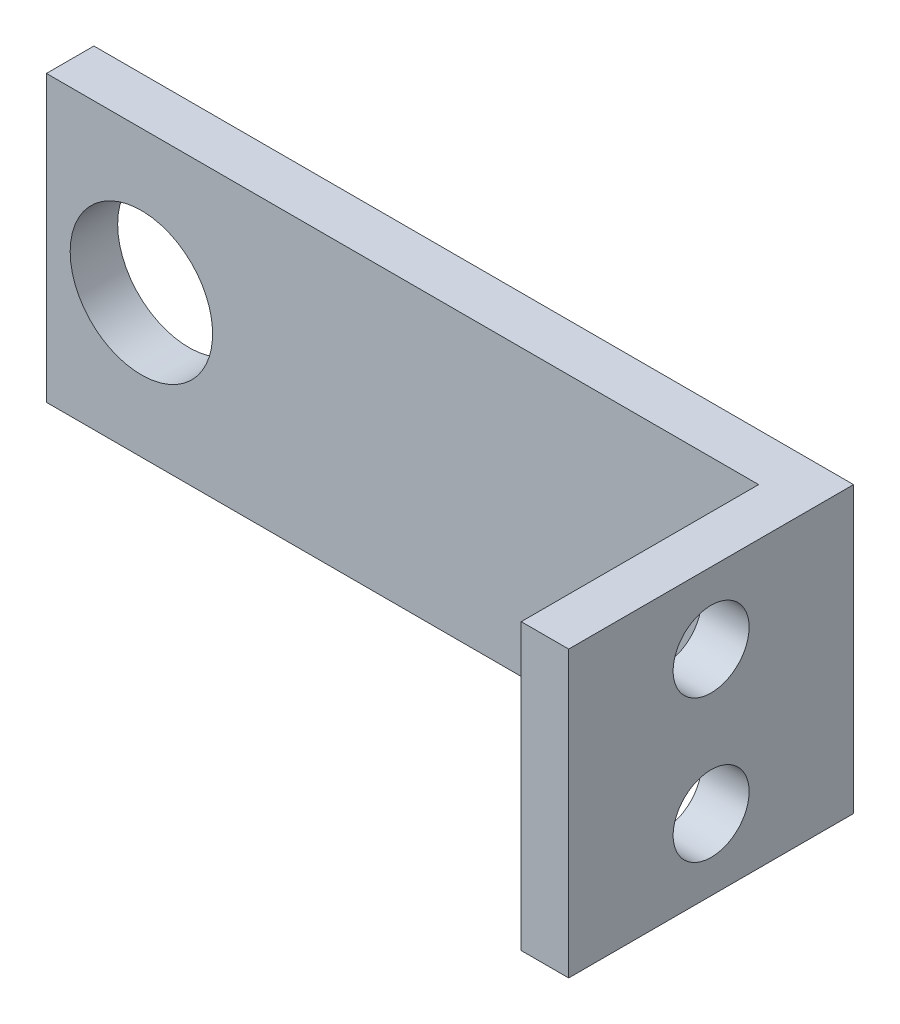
ISO-10303-21;
HEADER;
FILE_DESCRIPTION(('STEP AP214'),'2;1');
FILE_NAME('part.step','',(''),(''),'','','');
FILE_SCHEMA(('AUTOMOTIVE_DESIGN { 1 0 10303 214 1 1 1 1 }'));
ENDSEC;
DATA;
#1=APPLICATION_CONTEXT('core data for automotive mechanical design processes');
#2=APPLICATION_PROTOCOL_DEFINITION('international standard','automotive_design',2000,#1);
#3=PRODUCT_CONTEXT('',#1,'mechanical');
#4=PRODUCT('Part','Part','',(#3));
#5=PRODUCT_RELATED_PRODUCT_CATEGORY('part','',(#4));
#6=PRODUCT_DEFINITION_FORMATION('','',#4);
#7=PRODUCT_DEFINITION_CONTEXT('part definition',#1,'design');
#8=PRODUCT_DEFINITION('design','',#6,#7);
#9=PRODUCT_DEFINITION_SHAPE('','',#8);
#10=(LENGTH_UNIT() NAMED_UNIT(*) SI_UNIT(.MILLI.,.METRE.));
#11=(NAMED_UNIT(*) PLANE_ANGLE_UNIT() SI_UNIT($,.RADIAN.));
#12=(NAMED_UNIT(*) SI_UNIT($,.STERADIAN.) SOLID_ANGLE_UNIT());
#13=UNCERTAINTY_MEASURE_WITH_UNIT(LENGTH_MEASURE(1.E-05),#10,'distance_accuracy_value','');
#14=(GEOMETRIC_REPRESENTATION_CONTEXT(3) GLOBAL_UNCERTAINTY_ASSIGNED_CONTEXT((#13)) GLOBAL_UNIT_ASSIGNED_CONTEXT((#10,
#11,#12)) REPRESENTATION_CONTEXT('',''));
#15=CARTESIAN_POINT('',(0.,0.,0.));
#16=DIRECTION('',(0.,0.,1.));
#17=DIRECTION('',(1.,0.,0.));
#18=AXIS2_PLACEMENT_3D('',#15,#16,#17);
#19=CARTESIAN_POINT('',(0.,30.,5.));
#20=DIRECTION('',(0.,0.,-1.));
#21=DIRECTION('',(-1.,0.,0.));
#22=AXIS2_PLACEMENT_3D('',#19,#20,#21);
#23=PLANE('',#22);
#24=CARTESIAN_POINT('',(9.99999999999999,15.,5.));
#25=DIRECTION('',(0.,0.,-1.));
#26=DIRECTION('',(-1.,0.,0.));
#27=AXIS2_PLACEMENT_3D('',#24,#25,#26);
#28=CIRCLE('',#27,7.5);
#29=CARTESIAN_POINT('',(2.5,15.,5.));
#30=VERTEX_POINT('',#29);
#31=EDGE_CURVE('E103',#30,#30,#28,.T.);
#32=ORIENTED_EDGE('',*,*,#31,.T.);
#33=EDGE_LOOP('',(#32));
#34=FACE_BOUND('',#33,.T.);
#35=DIRECTION('',(0.,-1.,0.));
#36=VECTOR('',#35,1.);
#37=CARTESIAN_POINT('',(75.,30.,5.));
#38=LINE('',#37,#36);
#39=CARTESIAN_POINT('',(75.,30.,5.));
#40=VERTEX_POINT('',#39);
#41=CARTESIAN_POINT('',(75.,0.,5.));
#42=VERTEX_POINT('',#41);
#43=EDGE_CURVE('E52',#40,#42,#38,.T.);
#44=ORIENTED_EDGE('',*,*,#43,.F.);
#45=DIRECTION('',(-1.,0.,0.));
#46=VECTOR('',#45,1.);
#47=CARTESIAN_POINT('',(0.,30.,5.));
#48=LINE('',#47,#46);
#49=CARTESIAN_POINT('',(0.,30.,5.));
#50=VERTEX_POINT('',#49);
#51=EDGE_CURVE('E56',#40,#50,#48,.T.);
#52=ORIENTED_EDGE('',*,*,#51,.T.);
#53=DIRECTION('',(0.,-1.,0.));
#54=VECTOR('',#53,1.);
#55=CARTESIAN_POINT('',(0.,0.,5.));
#56=LINE('',#55,#54);
#57=CARTESIAN_POINT('',(0.,0.,5.));
#58=VERTEX_POINT('',#57);
#59=EDGE_CURVE('E88',#50,#58,#56,.T.);
#60=ORIENTED_EDGE('',*,*,#59,.T.);
#61=DIRECTION('',(1.,0.,0.));
#62=VECTOR('',#61,1.);
#63=CARTESIAN_POINT('',(0.,0.,5.));
#64=LINE('',#63,#62);
#65=EDGE_CURVE('E86',#58,#42,#64,.T.);
#66=ORIENTED_EDGE('',*,*,#65,.T.);
#67=EDGE_LOOP('',(#44,#52,#60,#66));
#68=FACE_BOUND('',#67,.T.);
#69=ADVANCED_FACE('F35',(#34,#68),#23,.F.);
#70=CARTESIAN_POINT('',(0.,0.,5.));
#71=DIRECTION('',(1.,0.,0.));
#72=DIRECTION('',(0.,0.,-1.));
#73=AXIS2_PLACEMENT_3D('',#70,#71,#72);
#74=PLANE('',#73);
#75=DIRECTION('',(0.,-1.,0.));
#76=VECTOR('',#75,1.);
#77=CARTESIAN_POINT('',(0.,0.,0.));
#78=LINE('',#77,#76);
#79=CARTESIAN_POINT('',(0.,30.,0.));
#80=VERTEX_POINT('',#79);
#81=CARTESIAN_POINT('',(0.,0.,0.));
#82=VERTEX_POINT('',#81);
#83=EDGE_CURVE('E109',#80,#82,#78,.T.);
#84=ORIENTED_EDGE('',*,*,#83,.T.);
#85=DIRECTION('',(0.,0.,-1.));
#86=VECTOR('',#85,1.);
#87=CARTESIAN_POINT('',(0.,0.,5.));
#88=LINE('',#87,#86);
#89=EDGE_CURVE('E11',#58,#82,#88,.T.);
#90=ORIENTED_EDGE('',*,*,#89,.F.);
#91=ORIENTED_EDGE('',*,*,#59,.F.);
#92=DIRECTION('',(0.,0.,-1.));
#93=VECTOR('',#92,1.);
#94=CARTESIAN_POINT('',(0.,30.,5.));
#95=LINE('',#94,#93);
#96=EDGE_CURVE('E157',#50,#80,#95,.T.);
#97=ORIENTED_EDGE('',*,*,#96,.T.);
#98=EDGE_LOOP('',(#84,#90,#91,#97));
#99=FACE_BOUND('',#98,.T.);
#100=ADVANCED_FACE('F37',(#99),#74,.F.);
#101=CARTESIAN_POINT('',(0.,0.,5.));
#102=DIRECTION('',(0.,1.,0.));
#103=DIRECTION('',(0.,0.,1.));
#104=AXIS2_PLACEMENT_3D('',#101,#102,#103);
#105=PLANE('',#104);
#106=DIRECTION('',(1.,0.,0.));
#107=VECTOR('',#106,1.);
#108=CARTESIAN_POINT('',(0.,0.,0.));
#109=LINE('',#108,#107);
#110=CARTESIAN_POINT('',(80.,0.,0.));
#111=VERTEX_POINT('',#110);
#112=EDGE_CURVE('E145',#82,#111,#109,.T.);
#113=ORIENTED_EDGE('',*,*,#112,.T.);
#114=DIRECTION('',(0.,0.,-1.));
#115=VECTOR('',#114,1.);
#116=CARTESIAN_POINT('',(80.,0.,5.));
#117=LINE('',#116,#115);
#118=CARTESIAN_POINT('',(80.,0.,30.));
#119=VERTEX_POINT('',#118);
#120=EDGE_CURVE('E44',#119,#111,#117,.T.);
#121=ORIENTED_EDGE('',*,*,#120,.F.);
#122=DIRECTION('',(1.,0.,0.));
#123=VECTOR('',#122,1.);
#124=CARTESIAN_POINT('',(80.,0.,30.));
#125=LINE('',#124,#123);
#126=CARTESIAN_POINT('',(75.,0.,30.));
#127=VERTEX_POINT('',#126);
#128=EDGE_CURVE('E107',#127,#119,#125,.T.);
#129=ORIENTED_EDGE('',*,*,#128,.F.);
#130=DIRECTION('',(0.,0.,-1.));
#131=VECTOR('',#130,1.);
#132=CARTESIAN_POINT('',(75.,0.,30.));
#133=LINE('',#132,#131);
#134=EDGE_CURVE('E98',#127,#42,#133,.T.);
#135=ORIENTED_EDGE('',*,*,#134,.T.);
#136=ORIENTED_EDGE('',*,*,#65,.F.);
#137=ORIENTED_EDGE('',*,*,#89,.T.);
#138=EDGE_LOOP('',(#113,#121,#129,#135,#136,#137));
#139=FACE_BOUND('',#138,.T.);
#140=ADVANCED_FACE('F105',(#139),#105,.F.);
#141=CARTESIAN_POINT('',(80.,0.,5.));
#142=DIRECTION('',(-1.,0.,0.));
#143=DIRECTION('',(0.,0.,1.));
#144=AXIS2_PLACEMENT_3D('',#141,#142,#143);
#145=PLANE('',#144);
#146=CARTESIAN_POINT('',(80.,7.5,15.));
#147=DIRECTION('',(1.,0.,0.));
#148=DIRECTION('',(0.,0.,-1.));
#149=AXIS2_PLACEMENT_3D('',#146,#147,#148);
#150=CIRCLE('',#149,4.);
#151=CARTESIAN_POINT('',(80.,7.5,11.));
#152=VERTEX_POINT('',#151);
#153=EDGE_CURVE('E132',#152,#152,#150,.T.);
#154=ORIENTED_EDGE('',*,*,#153,.F.);
#155=EDGE_LOOP('',(#154));
#156=FACE_BOUND('',#155,.T.);
#157=CARTESIAN_POINT('',(80.,22.5,15.));
#158=DIRECTION('',(1.,0.,0.));
#159=DIRECTION('',(0.,0.,-1.));
#160=AXIS2_PLACEMENT_3D('',#157,#158,#159);
#161=CIRCLE('',#160,4.);
#162=CARTESIAN_POINT('',(80.,22.5,11.));
#163=VERTEX_POINT('',#162);
#164=EDGE_CURVE('E122',#163,#163,#161,.T.);
#165=ORIENTED_EDGE('',*,*,#164,.F.);
#166=EDGE_LOOP('',(#165));
#167=FACE_BOUND('',#166,.T.);
#168=DIRECTION('',(0.,1.,0.));
#169=VECTOR('',#168,1.);
#170=CARTESIAN_POINT('',(80.,0.,0.));
#171=LINE('',#170,#169);
#172=CARTESIAN_POINT('',(80.,30.,0.));
#173=VERTEX_POINT('',#172);
#174=EDGE_CURVE('E147',#111,#173,#171,.T.);
#175=ORIENTED_EDGE('',*,*,#174,.T.);
#176=DIRECTION('',(0.,0.,-1.));
#177=VECTOR('',#176,1.);
#178=CARTESIAN_POINT('',(80.,30.,5.));
#179=LINE('',#178,#177);
#180=CARTESIAN_POINT('',(80.,30.,30.));
#181=VERTEX_POINT('',#180);
#182=EDGE_CURVE('E159',#181,#173,#179,.T.);
#183=ORIENTED_EDGE('',*,*,#182,.F.);
#184=DIRECTION('',(0.,1.,0.));
#185=VECTOR('',#184,1.);
#186=CARTESIAN_POINT('',(80.,30.,30.));
#187=LINE('',#186,#185);
#188=EDGE_CURVE('E102',#119,#181,#187,.T.);
#189=ORIENTED_EDGE('',*,*,#188,.F.);
#190=ORIENTED_EDGE('',*,*,#120,.T.);
#191=EDGE_LOOP('',(#175,#183,#189,#190));
#192=FACE_BOUND('',#191,.T.);
#193=ADVANCED_FACE('F168',(#156,#167,#192),#145,.F.);
#194=CARTESIAN_POINT('',(0.,30.,5.));
#195=DIRECTION('',(0.,-1.,0.));
#196=DIRECTION('',(0.,0.,-1.));
#197=AXIS2_PLACEMENT_3D('',#194,#195,#196);
#198=PLANE('',#197);
#199=DIRECTION('',(-1.,0.,0.));
#200=VECTOR('',#199,1.);
#201=CARTESIAN_POINT('',(0.,30.,0.));
#202=LINE('',#201,#200);
#203=EDGE_CURVE('E149',#173,#80,#202,.T.);
#204=ORIENTED_EDGE('',*,*,#203,.T.);
#205=ORIENTED_EDGE('',*,*,#96,.F.);
#206=ORIENTED_EDGE('',*,*,#51,.F.);
#207=DIRECTION('',(0.,0.,-1.));
#208=VECTOR('',#207,1.);
#209=CARTESIAN_POINT('',(75.,30.,30.));
#210=LINE('',#209,#208);
#211=CARTESIAN_POINT('',(75.,30.,30.));
#212=VERTEX_POINT('',#211);
#213=EDGE_CURVE('E101',#212,#40,#210,.T.);
#214=ORIENTED_EDGE('',*,*,#213,.F.);
#215=DIRECTION('',(-1.,0.,0.));
#216=VECTOR('',#215,1.);
#217=CARTESIAN_POINT('',(80.,30.,30.));
#218=LINE('',#217,#216);
#219=EDGE_CURVE('E140',#181,#212,#218,.T.);
#220=ORIENTED_EDGE('',*,*,#219,.F.);
#221=ORIENTED_EDGE('',*,*,#182,.T.);
#222=EDGE_LOOP('',(#204,#205,#206,#214,#220,#221));
#223=FACE_BOUND('',#222,.T.);
#224=ADVANCED_FACE('F173',(#223),#198,.F.);
#225=CARTESIAN_POINT('',(0.,30.,0.));
#226=DIRECTION('',(0.,0.,-1.));
#227=DIRECTION('',(-1.,0.,0.));
#228=AXIS2_PLACEMENT_3D('',#225,#226,#227);
#229=PLANE('',#228);
#230=CARTESIAN_POINT('',(9.99999999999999,15.,0.));
#231=DIRECTION('',(0.,0.,-1.));
#232=DIRECTION('',(-1.,0.,0.));
#233=AXIS2_PLACEMENT_3D('',#230,#231,#232);
#234=CIRCLE('',#233,7.5);
#235=CARTESIAN_POINT('',(2.5,15.,0.));
#236=VERTEX_POINT('',#235);
#237=EDGE_CURVE('E121',#236,#236,#234,.T.);
#238=ORIENTED_EDGE('',*,*,#237,.F.);
#239=EDGE_LOOP('',(#238));
#240=FACE_BOUND('',#239,.T.);
#241=ORIENTED_EDGE('',*,*,#83,.F.);
#242=ORIENTED_EDGE('',*,*,#203,.F.);
#243=ORIENTED_EDGE('',*,*,#174,.F.);
#244=ORIENTED_EDGE('',*,*,#112,.F.);
#245=EDGE_LOOP('',(#241,#242,#243,#244));
#246=FACE_BOUND('',#245,.T.);
#247=ADVANCED_FACE('F171',(#240,#246),#229,.T.);
#248=CARTESIAN_POINT('',(75.,30.,30.));
#249=DIRECTION('',(1.,0.,0.));
#250=DIRECTION('',(0.,0.,-1.));
#251=AXIS2_PLACEMENT_3D('',#248,#249,#250);
#252=PLANE('',#251);
#253=CARTESIAN_POINT('',(75.,7.5,15.));
#254=DIRECTION('',(1.,0.,0.));
#255=DIRECTION('',(0.,0.,-1.));
#256=AXIS2_PLACEMENT_3D('',#253,#254,#255);
#257=CIRCLE('',#256,4.);
#258=CARTESIAN_POINT('',(75.,7.5,11.));
#259=VERTEX_POINT('',#258);
#260=EDGE_CURVE('E39',#259,#259,#257,.T.);
#261=ORIENTED_EDGE('',*,*,#260,.T.);
#262=EDGE_LOOP('',(#261));
#263=FACE_BOUND('',#262,.T.);
#264=CARTESIAN_POINT('',(75.,22.5,15.));
#265=DIRECTION('',(1.,0.,0.));
#266=DIRECTION('',(0.,0.,-1.));
#267=AXIS2_PLACEMENT_3D('',#264,#265,#266);
#268=CIRCLE('',#267,4.);
#269=CARTESIAN_POINT('',(75.,22.5,11.));
#270=VERTEX_POINT('',#269);
#271=EDGE_CURVE('E119',#270,#270,#268,.T.);
#272=ORIENTED_EDGE('',*,*,#271,.T.);
#273=EDGE_LOOP('',(#272));
#274=FACE_BOUND('',#273,.T.);
#275=ORIENTED_EDGE('',*,*,#43,.T.);
#276=ORIENTED_EDGE('',*,*,#134,.F.);
#277=DIRECTION('',(0.,-1.,0.));
#278=VECTOR('',#277,1.);
#279=CARTESIAN_POINT('',(75.,30.,30.));
#280=LINE('',#279,#278);
#281=EDGE_CURVE('E111',#212,#127,#280,.T.);
#282=ORIENTED_EDGE('',*,*,#281,.F.);
#283=ORIENTED_EDGE('',*,*,#213,.T.);
#284=EDGE_LOOP('',(#275,#276,#282,#283));
#285=FACE_BOUND('',#284,.T.);
#286=ADVANCED_FACE('F96',(#263,#274,#285),#252,.F.);
#287=CARTESIAN_POINT('',(80.,0.,30.));
#288=DIRECTION('',(0.,0.,-1.));
#289=DIRECTION('',(-1.,0.,0.));
#290=AXIS2_PLACEMENT_3D('',#287,#288,#289);
#291=PLANE('',#290);
#292=ORIENTED_EDGE('',*,*,#188,.T.);
#293=ORIENTED_EDGE('',*,*,#219,.T.);
#294=ORIENTED_EDGE('',*,*,#281,.T.);
#295=ORIENTED_EDGE('',*,*,#128,.T.);
#296=EDGE_LOOP('',(#292,#293,#294,#295));
#297=FACE_BOUND('',#296,.T.);
#298=ADVANCED_FACE('F176',(#297),#291,.F.);
#299=CARTESIAN_POINT('',(9.99999999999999,15.,30.000025));
#300=DIRECTION('',(0.,0.,-1.));
#301=DIRECTION('',(-1.,0.,0.));
#302=AXIS2_PLACEMENT_3D('',#299,#300,#301);
#303=CYLINDRICAL_SURFACE('',#302,7.5);
#304=CARTESIAN_POINT('',(2.5,15.,0.));
#305=CARTESIAN_POINT('',(2.5,15.,0.0520833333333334));
#306=CARTESIAN_POINT('',(2.5,15.,0.104166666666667));
#307=CARTESIAN_POINT('',(2.5,15.,0.208333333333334));
#308=CARTESIAN_POINT('',(2.5,15.,0.260416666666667));
#309=CARTESIAN_POINT('',(2.5,15.,0.364583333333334));
#310=CARTESIAN_POINT('',(2.5,15.,0.416666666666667));
#311=CARTESIAN_POINT('',(2.5,15.,0.520833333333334));
#312=CARTESIAN_POINT('',(2.5,15.,0.572916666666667));
#313=CARTESIAN_POINT('',(2.5,15.,0.677083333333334));
#314=CARTESIAN_POINT('',(2.5,15.,0.729166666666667));
#315=CARTESIAN_POINT('',(2.5,15.,0.833333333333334));
#316=CARTESIAN_POINT('',(2.5,15.,0.885416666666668));
#317=CARTESIAN_POINT('',(2.5,15.,0.989583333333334));
#318=CARTESIAN_POINT('',(2.5,15.,1.04166666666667));
#319=CARTESIAN_POINT('',(2.5,15.,1.14583333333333));
#320=CARTESIAN_POINT('',(2.5,15.,1.19791666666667));
#321=CARTESIAN_POINT('',(2.5,15.,1.30208333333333));
#322=CARTESIAN_POINT('',(2.5,15.,1.35416666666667));
#323=CARTESIAN_POINT('',(2.5,15.,1.45833333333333));
#324=CARTESIAN_POINT('',(2.5,15.,1.51041666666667));
#325=CARTESIAN_POINT('',(2.5,15.,1.61458333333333));
#326=CARTESIAN_POINT('',(2.5,15.,1.66666666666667));
#327=CARTESIAN_POINT('',(2.5,15.,1.77083333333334));
#328=CARTESIAN_POINT('',(2.5,15.,1.82291666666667));
#329=CARTESIAN_POINT('',(2.5,15.,1.92708333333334));
#330=CARTESIAN_POINT('',(2.5,15.,1.97916666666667));
#331=CARTESIAN_POINT('',(2.5,15.,2.08333333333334));
#332=CARTESIAN_POINT('',(2.5,15.,2.13541666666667));
#333=CARTESIAN_POINT('',(2.5,15.,2.23958333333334));
#334=CARTESIAN_POINT('',(2.5,15.,2.29166666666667));
#335=CARTESIAN_POINT('',(2.5,15.,2.39583333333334));
#336=CARTESIAN_POINT('',(2.5,15.,2.44791666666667));
#337=CARTESIAN_POINT('',(2.5,15.,2.55208333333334));
#338=CARTESIAN_POINT('',(2.5,15.,2.60416666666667));
#339=CARTESIAN_POINT('',(2.5,15.,2.70833333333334));
#340=CARTESIAN_POINT('',(2.5,15.,2.76041666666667));
#341=CARTESIAN_POINT('',(2.5,15.,2.86458333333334));
#342=CARTESIAN_POINT('',(2.5,15.,2.91666666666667));
#343=CARTESIAN_POINT('',(2.5,15.,3.02083333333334));
#344=CARTESIAN_POINT('',(2.5,15.,3.07291666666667));
#345=CARTESIAN_POINT('',(2.5,15.,3.17708333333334));
#346=CARTESIAN_POINT('',(2.5,15.,3.22916666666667));
#347=CARTESIAN_POINT('',(2.5,15.,3.33333333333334));
#348=CARTESIAN_POINT('',(2.5,15.,3.38541666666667));
#349=CARTESIAN_POINT('',(2.5,15.,3.48958333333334));
#350=CARTESIAN_POINT('',(2.5,15.,3.54166666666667));
#351=CARTESIAN_POINT('',(2.5,15.,3.64583333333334));
#352=CARTESIAN_POINT('',(2.5,15.,3.69791666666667));
#353=CARTESIAN_POINT('',(2.5,15.,3.80208333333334));
#354=CARTESIAN_POINT('',(2.5,15.,3.85416666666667));
#355=CARTESIAN_POINT('',(2.5,15.,3.95833333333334));
#356=CARTESIAN_POINT('',(2.5,15.,4.01041666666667));
#357=CARTESIAN_POINT('',(2.5,15.,4.11458333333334));
#358=CARTESIAN_POINT('',(2.5,15.,4.16666666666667));
#359=CARTESIAN_POINT('',(2.5,15.,4.27083333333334));
#360=CARTESIAN_POINT('',(2.5,15.,4.32291666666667));
#361=CARTESIAN_POINT('',(2.5,15.,4.42708333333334));
#362=CARTESIAN_POINT('',(2.5,15.,4.47916666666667));
#363=CARTESIAN_POINT('',(2.5,15.,4.58333333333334));
#364=CARTESIAN_POINT('',(2.5,15.,4.63541666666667));
#365=CARTESIAN_POINT('',(2.5,15.,4.73958333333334));
#366=CARTESIAN_POINT('',(2.5,15.,4.79166666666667));
#367=CARTESIAN_POINT('',(2.5,15.,4.89583333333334));
#368=CARTESIAN_POINT('',(2.5,15.,4.94791666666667));
#369=CARTESIAN_POINT('',(2.5,15.,5.));
#370=B_SPLINE_CURVE_WITH_KNOTS('',3,(#304,#305,#306,#307,#308,#309,#310,#311,#312,#313,#314,
#315,#316,#317,#318,#319,#320,#321,#322,#323,#324,#325,#326,#327,#328,#329,#330,#331,#332,#333,
#334,#335,#336,#337,#338,#339,#340,#341,#342,#343,#344,#345,#346,#347,#348,#349,#350,#351,#352,
#353,#354,#355,#356,#357,#358,#359,#360,#361,#362,#363,#364,#365,#366,#367,#368,#369),
.UNSPECIFIED.,.F.,.F.,(4,2,2,2,2,2,2,2,2,2,2,2,2,2,2,2,2,2,2,2,2,2,2,2,2,2,2,2,2,2,2,2,4),(0.,
0.15625,0.3125,0.46875,0.625000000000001,0.781250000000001,0.937500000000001,1.09375,1.25,
1.40625,1.5625,1.71875,1.875,2.03125,2.1875,2.34375,2.5,2.65625,2.8125,2.96875,3.125,3.28125,
3.4375,3.59375,3.75,3.90625,4.0625,4.21875,4.375,4.53125,4.6875,4.84375,5.),.UNSPECIFIED.);
#371=EDGE_CURVE('BSEAM178',#236,#30,#370,.T.);
#372=ORIENTED_EDGE('',*,*,#237,.T.);
#373=ORIENTED_EDGE('',*,*,#31,.F.);
#374=ORIENTED_EDGE('',*,*,#371,.T.);
#375=ORIENTED_EDGE('',*,*,#371,.F.);
#376=EDGE_LOOP('',(#372,#374,#373,#375));
#377=FACE_BOUND('',#376,.T.);
#378=ADVANCED_FACE('F178',(#377),#303,.F.);
#379=CARTESIAN_POINT('',(-2.50000000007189E-05,22.5,15.));
#380=DIRECTION('',(1.,0.,0.));
#381=DIRECTION('',(0.,0.,-1.));
#382=AXIS2_PLACEMENT_3D('',#379,#380,#381);
#383=CYLINDRICAL_SURFACE('',#382,4.);
#384=CARTESIAN_POINT('',(80.,22.5,11.));
#385=CARTESIAN_POINT('',(79.9479166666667,22.5,11.));
#386=CARTESIAN_POINT('',(79.8958333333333,22.5,11.));
#387=CARTESIAN_POINT('',(79.7916666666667,22.5,11.));
#388=CARTESIAN_POINT('',(79.7395833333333,22.5,11.));
#389=CARTESIAN_POINT('',(79.6354166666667,22.5,11.));
#390=CARTESIAN_POINT('',(79.5833333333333,22.5,11.));
#391=CARTESIAN_POINT('',(79.4791666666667,22.5,11.));
#392=CARTESIAN_POINT('',(79.4270833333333,22.5,11.));
#393=CARTESIAN_POINT('',(79.3229166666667,22.5,11.));
#394=CARTESIAN_POINT('',(79.2708333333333,22.5,11.));
#395=CARTESIAN_POINT('',(79.1666666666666,22.5,11.));
#396=CARTESIAN_POINT('',(79.1145833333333,22.5,11.));
#397=CARTESIAN_POINT('',(79.0104166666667,22.5,11.));
#398=CARTESIAN_POINT('',(78.9583333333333,22.5,11.));
#399=CARTESIAN_POINT('',(78.8541666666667,22.5,11.));
#400=CARTESIAN_POINT('',(78.8020833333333,22.5,11.));
#401=CARTESIAN_POINT('',(78.6979166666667,22.5,11.));
#402=CARTESIAN_POINT('',(78.6458333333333,22.5,11.));
#403=CARTESIAN_POINT('',(78.5416666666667,22.5,11.));
#404=CARTESIAN_POINT('',(78.4895833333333,22.5,11.));
#405=CARTESIAN_POINT('',(78.3854166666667,22.5,11.));
#406=CARTESIAN_POINT('',(78.3333333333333,22.5,11.));
#407=CARTESIAN_POINT('',(78.2291666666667,22.5,11.));
#408=CARTESIAN_POINT('',(78.1770833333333,22.5,11.));
#409=CARTESIAN_POINT('',(78.0729166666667,22.5,11.));
#410=CARTESIAN_POINT('',(78.0208333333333,22.5,11.));
#411=CARTESIAN_POINT('',(77.9166666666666,22.5,11.));
#412=CARTESIAN_POINT('',(77.8645833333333,22.5,11.));
#413=CARTESIAN_POINT('',(77.7604166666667,22.5,11.));
#414=CARTESIAN_POINT('',(77.7083333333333,22.5,11.));
#415=CARTESIAN_POINT('',(77.6041666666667,22.5,11.));
#416=CARTESIAN_POINT('',(77.5520833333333,22.5,11.));
#417=CARTESIAN_POINT('',(77.4479166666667,22.5,11.));
#418=CARTESIAN_POINT('',(77.3958333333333,22.5,11.));
#419=CARTESIAN_POINT('',(77.2916666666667,22.5,11.));
#420=CARTESIAN_POINT('',(77.2395833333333,22.5,11.));
#421=CARTESIAN_POINT('',(77.1354166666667,22.5,11.));
#422=CARTESIAN_POINT('',(77.0833333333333,22.5,11.));
#423=CARTESIAN_POINT('',(76.9791666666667,22.5,11.));
#424=CARTESIAN_POINT('',(76.9270833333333,22.5,11.));
#425=CARTESIAN_POINT('',(76.8229166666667,22.5,11.));
#426=CARTESIAN_POINT('',(76.7708333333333,22.5,11.));
#427=CARTESIAN_POINT('',(76.6666666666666,22.5,11.));
#428=CARTESIAN_POINT('',(76.6145833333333,22.5,11.));
#429=CARTESIAN_POINT('',(76.5104166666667,22.5,11.));
#430=CARTESIAN_POINT('',(76.4583333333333,22.5,11.));
#431=CARTESIAN_POINT('',(76.3541666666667,22.5,11.));
#432=CARTESIAN_POINT('',(76.3020833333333,22.5,11.));
#433=CARTESIAN_POINT('',(76.1979166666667,22.5,11.));
#434=CARTESIAN_POINT('',(76.1458333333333,22.5,11.));
#435=CARTESIAN_POINT('',(76.0416666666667,22.5,11.));
#436=CARTESIAN_POINT('',(75.9895833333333,22.5,11.));
#437=CARTESIAN_POINT('',(75.8854166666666,22.5,11.));
#438=CARTESIAN_POINT('',(75.8333333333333,22.5,11.));
#439=CARTESIAN_POINT('',(75.7291666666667,22.5,11.));
#440=CARTESIAN_POINT('',(75.6770833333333,22.5,11.));
#441=CARTESIAN_POINT('',(75.5729166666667,22.5,11.));
#442=CARTESIAN_POINT('',(75.5208333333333,22.5,11.));
#443=CARTESIAN_POINT('',(75.4166666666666,22.5,11.));
#444=CARTESIAN_POINT('',(75.3645833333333,22.5,11.));
#445=CARTESIAN_POINT('',(75.2604166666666,22.5,11.));
#446=CARTESIAN_POINT('',(75.2083333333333,22.5,11.));
#447=CARTESIAN_POINT('',(75.1041666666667,22.5,11.));
#448=CARTESIAN_POINT('',(75.0520833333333,22.5,11.));
#449=CARTESIAN_POINT('',(75.,22.5,11.));
#450=B_SPLINE_CURVE_WITH_KNOTS('',3,(#384,#385,#386,#387,#388,#389,#390,#391,#392,#393,#394,
#395,#396,#397,#398,#399,#400,#401,#402,#403,#404,#405,#406,#407,#408,#409,#410,#411,#412,#413,
#414,#415,#416,#417,#418,#419,#420,#421,#422,#423,#424,#425,#426,#427,#428,#429,#430,#431,#432,
#433,#434,#435,#436,#437,#438,#439,#440,#441,#442,#443,#444,#445,#446,#447,#448,#449),
.UNSPECIFIED.,.F.,.F.,(4,2,2,2,2,2,2,2,2,2,2,2,2,2,2,2,2,2,2,2,2,2,2,2,2,2,2,2,2,2,2,2,4),(0.,
0.156249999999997,0.312499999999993,0.468750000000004,0.625000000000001,0.781249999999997,
0.937500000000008,1.09375,1.25,1.40625,1.56249999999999,1.71875,1.875,2.03125,2.18750000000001,
2.34375000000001,2.5,2.65625,2.8125,2.96875000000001,3.125,3.28125,3.43750000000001,
3.59375000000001,3.75,3.90625,4.0625,4.21875000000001,4.375,4.53125,4.68750000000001,
4.84375000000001,5.),.UNSPECIFIED.);
#451=EDGE_CURVE('BSEAM184',#163,#270,#450,.T.);
#452=ORIENTED_EDGE('',*,*,#164,.T.);
#453=ORIENTED_EDGE('',*,*,#271,.F.);
#454=ORIENTED_EDGE('',*,*,#451,.T.);
#455=ORIENTED_EDGE('',*,*,#451,.F.);
#456=EDGE_LOOP('',(#452,#454,#453,#455));
#457=FACE_BOUND('',#456,.T.);
#458=ADVANCED_FACE('F184',(#457),#383,.F.);
#459=CARTESIAN_POINT('',(-2.50000000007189E-05,7.5,15.));
#460=DIRECTION('',(1.,0.,0.));
#461=DIRECTION('',(0.,0.,-1.));
#462=AXIS2_PLACEMENT_3D('',#459,#460,#461);
#463=CYLINDRICAL_SURFACE('',#462,4.);
#464=CARTESIAN_POINT('',(80.,7.5,11.));
#465=CARTESIAN_POINT('',(79.9479166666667,7.5,11.));
#466=CARTESIAN_POINT('',(79.8958333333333,7.5,11.));
#467=CARTESIAN_POINT('',(79.7916666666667,7.5,11.));
#468=CARTESIAN_POINT('',(79.7395833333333,7.5,11.));
#469=CARTESIAN_POINT('',(79.6354166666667,7.5,11.));
#470=CARTESIAN_POINT('',(79.5833333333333,7.5,11.));
#471=CARTESIAN_POINT('',(79.4791666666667,7.5,11.));
#472=CARTESIAN_POINT('',(79.4270833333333,7.5,11.));
#473=CARTESIAN_POINT('',(79.3229166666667,7.5,11.));
#474=CARTESIAN_POINT('',(79.2708333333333,7.5,11.));
#475=CARTESIAN_POINT('',(79.1666666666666,7.5,11.));
#476=CARTESIAN_POINT('',(79.1145833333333,7.5,11.));
#477=CARTESIAN_POINT('',(79.0104166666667,7.5,11.));
#478=CARTESIAN_POINT('',(78.9583333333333,7.5,11.));
#479=CARTESIAN_POINT('',(78.8541666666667,7.5,11.));
#480=CARTESIAN_POINT('',(78.8020833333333,7.5,11.));
#481=CARTESIAN_POINT('',(78.6979166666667,7.5,11.));
#482=CARTESIAN_POINT('',(78.6458333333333,7.5,11.));
#483=CARTESIAN_POINT('',(78.5416666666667,7.5,11.));
#484=CARTESIAN_POINT('',(78.4895833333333,7.5,11.));
#485=CARTESIAN_POINT('',(78.3854166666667,7.5,11.));
#486=CARTESIAN_POINT('',(78.3333333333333,7.5,11.));
#487=CARTESIAN_POINT('',(78.2291666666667,7.5,11.));
#488=CARTESIAN_POINT('',(78.1770833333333,7.5,11.));
#489=CARTESIAN_POINT('',(78.0729166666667,7.5,11.));
#490=CARTESIAN_POINT('',(78.0208333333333,7.5,11.));
#491=CARTESIAN_POINT('',(77.9166666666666,7.5,11.));
#492=CARTESIAN_POINT('',(77.8645833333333,7.5,11.));
#493=CARTESIAN_POINT('',(77.7604166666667,7.5,11.));
#494=CARTESIAN_POINT('',(77.7083333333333,7.5,11.));
#495=CARTESIAN_POINT('',(77.6041666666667,7.5,11.));
#496=CARTESIAN_POINT('',(77.5520833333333,7.5,11.));
#497=CARTESIAN_POINT('',(77.4479166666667,7.5,11.));
#498=CARTESIAN_POINT('',(77.3958333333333,7.5,11.));
#499=CARTESIAN_POINT('',(77.2916666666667,7.5,11.));
#500=CARTESIAN_POINT('',(77.2395833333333,7.5,11.));
#501=CARTESIAN_POINT('',(77.1354166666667,7.5,11.));
#502=CARTESIAN_POINT('',(77.0833333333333,7.5,11.));
#503=CARTESIAN_POINT('',(76.9791666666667,7.5,11.));
#504=CARTESIAN_POINT('',(76.9270833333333,7.5,11.));
#505=CARTESIAN_POINT('',(76.8229166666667,7.5,11.));
#506=CARTESIAN_POINT('',(76.7708333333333,7.5,11.));
#507=CARTESIAN_POINT('',(76.6666666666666,7.5,11.));
#508=CARTESIAN_POINT('',(76.6145833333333,7.5,11.));
#509=CARTESIAN_POINT('',(76.5104166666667,7.5,11.));
#510=CARTESIAN_POINT('',(76.4583333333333,7.5,11.));
#511=CARTESIAN_POINT('',(76.3541666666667,7.5,11.));
#512=CARTESIAN_POINT('',(76.3020833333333,7.5,11.));
#513=CARTESIAN_POINT('',(76.1979166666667,7.5,11.));
#514=CARTESIAN_POINT('',(76.1458333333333,7.5,11.));
#515=CARTESIAN_POINT('',(76.0416666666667,7.5,11.));
#516=CARTESIAN_POINT('',(75.9895833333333,7.5,11.));
#517=CARTESIAN_POINT('',(75.8854166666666,7.5,11.));
#518=CARTESIAN_POINT('',(75.8333333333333,7.5,11.));
#519=CARTESIAN_POINT('',(75.7291666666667,7.5,11.));
#520=CARTESIAN_POINT('',(75.6770833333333,7.5,11.));
#521=CARTESIAN_POINT('',(75.5729166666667,7.5,11.));
#522=CARTESIAN_POINT('',(75.5208333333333,7.5,11.));
#523=CARTESIAN_POINT('',(75.4166666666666,7.5,11.));
#524=CARTESIAN_POINT('',(75.3645833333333,7.5,11.));
#525=CARTESIAN_POINT('',(75.2604166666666,7.5,11.));
#526=CARTESIAN_POINT('',(75.2083333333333,7.5,11.));
#527=CARTESIAN_POINT('',(75.1041666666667,7.5,11.));
#528=CARTESIAN_POINT('',(75.0520833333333,7.5,11.));
#529=CARTESIAN_POINT('',(75.,7.5,11.));
#530=B_SPLINE_CURVE_WITH_KNOTS('',3,(#464,#465,#466,#467,#468,#469,#470,#471,#472,#473,#474,
#475,#476,#477,#478,#479,#480,#481,#482,#483,#484,#485,#486,#487,#488,#489,#490,#491,#492,#493,
#494,#495,#496,#497,#498,#499,#500,#501,#502,#503,#504,#505,#506,#507,#508,#509,#510,#511,#512,
#513,#514,#515,#516,#517,#518,#519,#520,#521,#522,#523,#524,#525,#526,#527,#528,#529),
.UNSPECIFIED.,.F.,.F.,(4,2,2,2,2,2,2,2,2,2,2,2,2,2,2,2,2,2,2,2,2,2,2,2,2,2,2,2,2,2,2,2,4),(0.,
0.156249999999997,0.312499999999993,0.468750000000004,0.625000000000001,0.781249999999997,
0.937500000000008,1.09375,1.25,1.40625,1.56249999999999,1.71875,1.875,2.03125,2.18750000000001,
2.34375000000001,2.5,2.65625,2.8125,2.96875000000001,3.125,3.28125,3.43750000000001,
3.59375000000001,3.75,3.90625,4.0625,4.21875000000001,4.375,4.53125,4.68750000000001,
4.84375000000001,5.),.UNSPECIFIED.);
#531=EDGE_CURVE('BSEAM243',#152,#259,#530,.T.);
#532=ORIENTED_EDGE('',*,*,#153,.T.);
#533=ORIENTED_EDGE('',*,*,#260,.F.);
#534=ORIENTED_EDGE('',*,*,#531,.T.);
#535=ORIENTED_EDGE('',*,*,#531,.F.);
#536=EDGE_LOOP('',(#532,#534,#533,#535));
#537=FACE_BOUND('',#536,.T.);
#538=ADVANCED_FACE('F243',(#537),#463,.F.);
#539=CLOSED_SHELL('',(#69,#100,#140,#193,#224,#247,#286,#298,#378,#458,#538));
#540=MANIFOLD_SOLID_BREP('B2',#539);
#541=ADVANCED_BREP_SHAPE_REPRESENTATION('',(#18,#540),#14);
#542=SHAPE_DEFINITION_REPRESENTATION(#9,#541);
ENDSEC;
END-ISO-10303-21;
